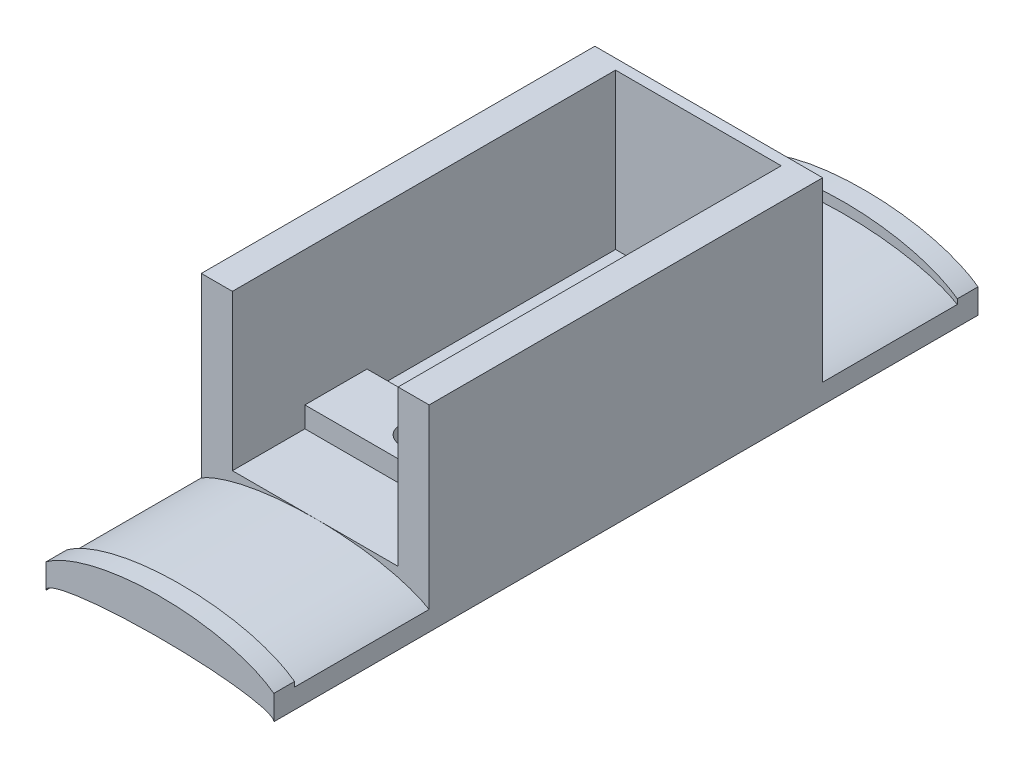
from build123d import *

# Parameters (mm, degrees)
SKETCH1_W           = 22
SKETCH1_H           = 38
BOSS_EXTRUDE1_DEPTH = 4
BOSS_EXTRUDE2_DEPTH = 15
SKETCH3_R           = 1.75
CUT_EXTRUDE1_DEPTH  = 47.400431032
BOSS_EXTRUDE3_START = 2
SKETCH4_R           = 1.75
SKETCH4_W           = 8
SKETCH4_H           = 15
BOSS_EXTRUDE3_DEPTH = 2
CUT_EXTRUDE2_DEPTH  = 3.5
CUT_EXTRUDE3_DEPTH  = 48.843494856
BOSS_EXTRUDE4_DEPTH = 13
BOSS_EXTRUDE5_DEPTH = 13
BOSS_EXTRUDE6_DEPTH = 2
BOSS_EXTRUDE7_DEPTH = 2


with BuildPart() as part:
    # Sketch1 → Boss-Extrude1 (new body)
    with BuildSketch(Plane(origin=(0, 0, 0), x_dir=(1, 0, 0), z_dir=(0, 1, 0))):
        with Locations((-11, 19)):
            Rectangle(SKETCH1_W, SKETCH1_H)
    extrude(amount=BOSS_EXTRUDE1_DEPTH)

    # Sketch2 → Boss-Extrude2 (add)
    with BuildSketch(Plane(origin=(0, 4, 0), x_dir=(1, 0, 0), z_dir=(0, 1, 0))):
        Polygon((-19, 0), (-19, 37), (-3, 37), (-3, 0), (0, 0), (0, 38), (-22, 38), (-22, 0), align=None)
    extrude(amount=BOSS_EXTRUDE2_DEPTH)

    # Sketch3 → Cut-Extrude1 (cut, through all)
    with BuildSketch(Plane(origin=(0, 4, 0), x_dir=(1, 0, 0), z_dir=(0, 1, 0))):
        with Locations(Location((-11, 10, 0), (0, 0, 270))):
            Circle(SKETCH3_R)
    extrude(amount=-CUT_EXTRUDE1_DEPTH, mode=Mode.SUBTRACT)

    # Sketch4 → Boss-Extrude3 (add)
    # profile 1 of 2: a face of its own
    with BuildSketch(Plane(origin=(0, 4, 0), x_dir=(1, 0, 0), z_dir=(0, 1, 0)).offset(BOSS_EXTRUDE3_START)):
        Polygon((-11, 13), (-19, 13), (-19, 7), (-3, 7), (-3, 13), align=None)
        with Locations(Location((-11, 10, 0), (0, 0, 270))):
            Circle(SKETCH4_R, mode=Mode.SUBTRACT)
    # profile 2 of 2: a face of its own
    with BuildSketch(Plane(origin=(0, 4, 0), x_dir=(1, 0, 0), z_dir=(0, 1, 0)).offset(BOSS_EXTRUDE3_START)):
        with Locations((-7, 20.5)):
            Rectangle(SKETCH4_W, SKETCH4_H)
    extrude(amount=-BOSS_EXTRUDE3_DEPTH)

    # Sketch5 → Cut-Extrude2 (cut)
    with BuildSketch(Plane.XZ):
        Polygon((-10.300546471, -6.607248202), (-13.588482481, -7.697879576), (-14.28793601, -11.090631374), (-11.699453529, -13.392751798), (-8.411517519, -12.302120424), (-7.71206399, -8.909368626), align=None)
    extrude(amount=-CUT_EXTRUDE2_DEPTH, mode=Mode.SUBTRACT)

    # Sketch6 → Cut-Extrude3 (cut, through all)
    with BuildSketch(Plane.XY):
        with BuildLine():
            add(Edge.make_bspline(
                [(0, 0), (0, 1.5), (-11, 1.5), (-22, 1.5), (-22, 0)],
                knots=[0, 0, 0, 1.570796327, 1.570796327, 3.141592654, 3.141592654, 3.141592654], degree=2, weights=[1, 0.707106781, 1, 0.707106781, 1]))
            Line((-22, 0), (0, 0))
        make_face()
        with BuildLine():
            Line((0, 0), (-22, 0))
            add(Edge.make_bspline(
                [(-22, 0), (-22, -1.5), (-11, -1.5), (0, -1.5), (0, 0)],
                knots=[3.141592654, 3.141592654, 3.141592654, 4.71238898, 4.71238898, 6.283185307, 6.283185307, 6.283185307], degree=2, weights=[1, 0.707106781, 1, 0.707106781, 1]))
        make_face()
    extrude(amount=-CUT_EXTRUDE3_DEPTH, mode=Mode.SUBTRACT)

    # Sketch8 → Boss-Extrude4 (add)
    with BuildSketch(Plane.XY):
        with BuildLine():
            Line((-22, 1.899894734), (-22, 0))
            add(Edge.make_bspline(
                [(0, 0), (0, 1.5), (-11, 1.5), (-22, 1.5), (-22, 0)],
                knots=[3.141592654, 3.141592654, 3.141592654, 4.71238898, 4.71238898, 6.283185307, 6.283185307, 6.283185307], degree=2, weights=[1, 0.707106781, 1, 0.707106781, 1]))
            Line((0, 0), (0, 1.899894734))
            add(Edge.make_bspline(
                [(0, 1.899894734), (-11, 8.421519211), (-22, 1.899894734)],
                knots=[0.494934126, 0.494934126, 0.494934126, 2.646658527, 2.646658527, 2.646658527], degree=2, weights=[1, 0.474973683, 1]))
        make_face()
    extrude(amount=BOSS_EXTRUDE4_DEPTH)

    # Sketch9 → Boss-Extrude5 (add)
    with BuildSketch(Plane(origin=(0, 0, -38), x_dir=(-1, 0, 0), z_dir=(0, 0, -1))):
        with BuildLine():
            Line((0, 1.899894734), (0, 0))
            add(Edge.make_bspline(
                [(22, 0), (22, 1.5), (11, 1.5), (0, 1.5), (0, 0)],
                knots=[0, 0, 0, 1.570796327, 1.570796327, 3.141592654, 3.141592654, 3.141592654], degree=2, weights=[1, 0.707106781, 1, 0.707106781, 1]))
            Line((22, 0), (22, 1.899894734))
            add(Edge.make_bspline(
                [(22, 1.899894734), (11, 8.421519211), (0, 1.899894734)],
                knots=[0.494934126, 0.494934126, 0.494934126, 2.646658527, 2.646658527, 2.646658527], degree=2, weights=[1, 0.474973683, 1]))
        make_face()
    extrude(amount=BOSS_EXTRUDE5_DEPTH)

    # Sketch12 → Boss-Extrude6 (add)
    with BuildSketch(Plane(origin=(0, 0, -51), x_dir=(-1, 0, 0), z_dir=(0, 0, -1))):
        with BuildLine():
            add(Edge.make_bspline(
                [(22, 0), (22, 1.5), (11, 1.5), (0, 1.5), (0, 0)],
                knots=[3.141592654, 3.141592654, 3.141592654, 4.71238898, 4.71238898, 6.283185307, 6.283185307, 6.283185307], degree=2, weights=[1, 0.707106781, 1, 0.707106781, 1]))
            Line((0, 0), (0, 1.899894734))
            add(Edge.make_bspline(
                [(22, 1.899894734), (11, 8.421519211), (0, 1.899894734)],
                knots=[0.494934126, 0.494934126, 0.494934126, 2.646658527, 2.646658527, 2.646658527], degree=2, weights=[1, 0.474973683, 1]))
            Line((22, 1.899894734), (22, 0))
        make_face()
        with BuildLine():
            add(Edge.make_bspline(
                [(22, 2.374868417), (11, 10.526899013), (0, 2.374868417)],
                knots=[3.63652678, 3.63652678, 3.63652678, 5.788251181, 5.788251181, 5.788251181], degree=2, weights=[1, 0.474973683, 1]))
            Line((0, 2.374868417), (0, 1.899894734))
            add(Edge.make_bspline(
                [(22, 1.899894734), (11, 8.421519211), (0, 1.899894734)],
                knots=[0.494934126, 0.494934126, 0.494934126, 2.646658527, 2.646658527, 2.646658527], degree=2, weights=[1, 0.474973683, 1]))
            Line((22, 1.899894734), (22, 2.374868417))
        make_face()
    extrude(amount=BOSS_EXTRUDE6_DEPTH)

    # Sketch11 → Boss-Extrude7 (add)
    with BuildSketch(Plane.XY.offset(13)):
        with BuildLine():
            add(Edge.make_bspline(
                [(0, 0), (0, 1.5), (-11, 1.5), (-22, 1.5), (-22, 0)],
                knots=[0, 0, 0, 1.570796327, 1.570796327, 3.141592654, 3.141592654, 3.141592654], degree=2, weights=[1, 0.707106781, 1, 0.707106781, 1]))
            Line((-22, 0), (-22, 1.899894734))
            add(Edge.make_bspline(
                [(0, 1.899894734), (-11, 8.421519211), (-22, 1.899894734)],
                knots=[0.494934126, 0.494934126, 0.494934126, 2.646658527, 2.646658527, 2.646658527], degree=2, weights=[1, 0.474973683, 1]))
            Line((0, 1.899894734), (0, 0))
        make_face()
        with BuildLine():
            Line((-22, 2.374868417), (-22, 1.899894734))
            add(Edge.make_bspline(
                [(0, 1.899894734), (-11, 8.421519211), (-22, 1.899894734)],
                knots=[0.494934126, 0.494934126, 0.494934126, 2.646658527, 2.646658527, 2.646658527], degree=2, weights=[1, 0.474973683, 1]))
            Line((0, 1.899894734), (0, 2.374868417))
            add(Edge.make_bspline(
                [(0, 2.374868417), (-11, 10.526899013), (-22, 2.374868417)],
                knots=[0.494934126, 0.494934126, 0.494934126, 2.646658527, 2.646658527, 2.646658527], degree=2, weights=[1, 0.474973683, 1]))
        make_face()
    extrude(amount=BOSS_EXTRUDE7_DEPTH)


solid = part.part
